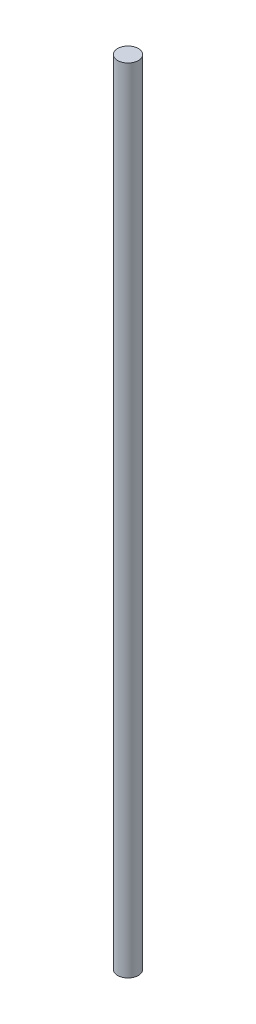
ISO-10303-21;
HEADER;
FILE_DESCRIPTION(('STEP AP214'),'2;1');
FILE_NAME('part.step','',(''),(''),'','','');
FILE_SCHEMA(('AUTOMOTIVE_DESIGN { 1 0 10303 214 1 1 1 1 }'));
ENDSEC;
DATA;
#1=APPLICATION_CONTEXT('core data for automotive mechanical design processes');
#2=APPLICATION_PROTOCOL_DEFINITION('international standard','automotive_design',2000,#1);
#3=PRODUCT_CONTEXT('',#1,'mechanical');
#4=PRODUCT('Part','Part','',(#3));
#5=PRODUCT_RELATED_PRODUCT_CATEGORY('part','',(#4));
#6=PRODUCT_DEFINITION_FORMATION('','',#4);
#7=PRODUCT_DEFINITION_CONTEXT('part definition',#1,'design');
#8=PRODUCT_DEFINITION('design','',#6,#7);
#9=PRODUCT_DEFINITION_SHAPE('','',#8);
#10=(LENGTH_UNIT() NAMED_UNIT(*) SI_UNIT(.MILLI.,.METRE.));
#11=(NAMED_UNIT(*) PLANE_ANGLE_UNIT() SI_UNIT($,.RADIAN.));
#12=(NAMED_UNIT(*) SI_UNIT($,.STERADIAN.) SOLID_ANGLE_UNIT());
#13=UNCERTAINTY_MEASURE_WITH_UNIT(LENGTH_MEASURE(1.E-05),#10,'distance_accuracy_value','');
#14=(GEOMETRIC_REPRESENTATION_CONTEXT(3) GLOBAL_UNCERTAINTY_ASSIGNED_CONTEXT((#13)) GLOBAL_UNIT_ASSIGNED_CONTEXT((#10,
#11,#12)) REPRESENTATION_CONTEXT('',''));
#15=CARTESIAN_POINT('',(0.,0.,0.));
#16=DIRECTION('',(0.,0.,1.));
#17=DIRECTION('',(1.,0.,0.));
#18=AXIS2_PLACEMENT_3D('',#15,#16,#17);
#19=CARTESIAN_POINT('',(0.,0.,0.));
#20=DIRECTION('',(0.,-1.,0.));
#21=DIRECTION('',(0.,0.,-1.));
#22=AXIS2_PLACEMENT_3D('',#19,#20,#21);
#23=PLANE('',#22);
#24=CARTESIAN_POINT('',(0.,0.,0.));
#25=DIRECTION('',(0.,-1.,0.));
#26=DIRECTION('',(0.,0.,-1.));
#27=AXIS2_PLACEMENT_3D('',#24,#25,#26);
#28=CIRCLE('',#27,12.5);
#29=CARTESIAN_POINT('',(0.,0.,-12.5));
#30=VERTEX_POINT('',#29);
#31=EDGE_CURVE('E10',#30,#30,#28,.T.);
#32=ORIENTED_EDGE('',*,*,#31,.T.);
#33=EDGE_LOOP('',(#32));
#34=FACE_BOUND('',#33,.T.);
#35=ADVANCED_FACE('F40',(#34),#23,.T.);
#36=CARTESIAN_POINT('',(0.,-10.,0.));
#37=DIRECTION('',(0.,-1.,0.));
#38=DIRECTION('',(0.,0.,-1.));
#39=AXIS2_PLACEMENT_3D('',#36,#37,#38);
#40=CYLINDRICAL_SURFACE('',#39,12.5);
#41=CARTESIAN_POINT('',(0.,950.,0.));
#42=DIRECTION('',(0.,-1.,0.));
#43=DIRECTION('',(0.,0.,-1.));
#44=AXIS2_PLACEMENT_3D('',#41,#42,#43);
#45=CIRCLE('',#44,12.5);
#46=CARTESIAN_POINT('',(0.,950.,-12.5));
#47=VERTEX_POINT('',#46);
#48=EDGE_CURVE('E43',#47,#47,#45,.T.);
#49=ORIENTED_EDGE('',*,*,#48,.T.);
#50=EDGE_LOOP('',(#49));
#51=FACE_BOUND('',#50,.T.);
#52=ORIENTED_EDGE('',*,*,#31,.F.);
#53=EDGE_LOOP('',(#52));
#54=FACE_BOUND('',#53,.T.);
#55=ADVANCED_FACE('F47',(#51,#54),#40,.T.);
#56=CARTESIAN_POINT('',(12.5,950.,0.));
#57=DIRECTION('',(0.,1.,0.));
#58=DIRECTION('',(0.,0.,1.));
#59=AXIS2_PLACEMENT_3D('',#56,#57,#58);
#60=PLANE('',#59);
#61=ORIENTED_EDGE('',*,*,#48,.F.);
#62=EDGE_LOOP('',(#61));
#63=FACE_BOUND('',#62,.T.);
#64=ADVANCED_FACE('F55',(#63),#60,.T.);
#65=CLOSED_SHELL('',(#35,#55,#64));
#66=MANIFOLD_SOLID_BREP('B2',#65);
#67=ADVANCED_BREP_SHAPE_REPRESENTATION('',(#18,#66),#14);
#68=SHAPE_DEFINITION_REPRESENTATION(#9,#67);
ENDSEC;
END-ISO-10303-21;
